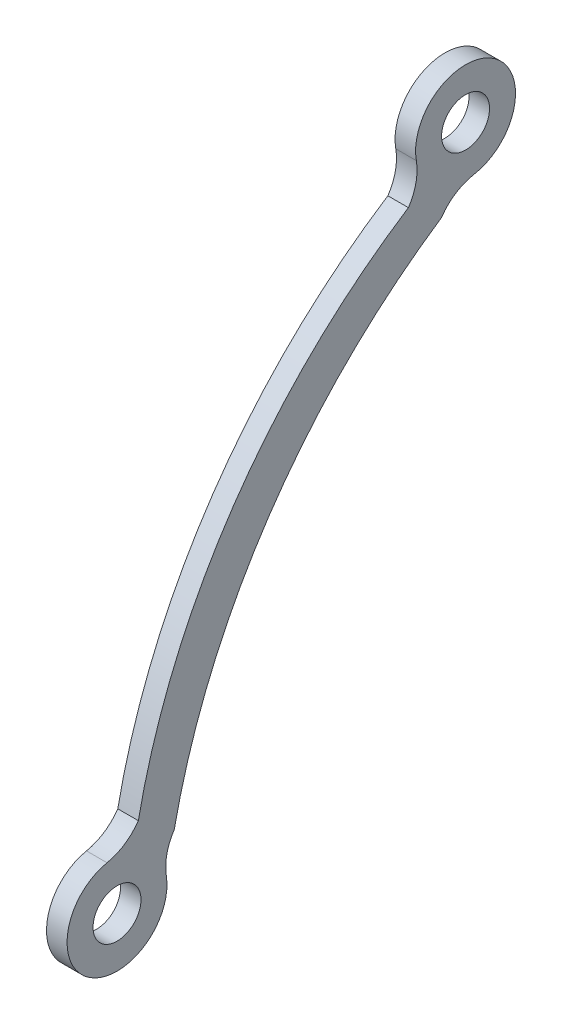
ISO-10303-21;
HEADER;
FILE_DESCRIPTION(('STEP AP214'),'2;1');
FILE_NAME('part.step','',(''),(''),'','','');
FILE_SCHEMA(('AUTOMOTIVE_DESIGN { 1 0 10303 214 1 1 1 1 }'));
ENDSEC;
DATA;
#1=APPLICATION_CONTEXT('core data for automotive mechanical design processes');
#2=APPLICATION_PROTOCOL_DEFINITION('international standard','automotive_design',2000,#1);
#3=PRODUCT_CONTEXT('',#1,'mechanical');
#4=PRODUCT('Part','Part','',(#3));
#5=PRODUCT_RELATED_PRODUCT_CATEGORY('part','',(#4));
#6=PRODUCT_DEFINITION_FORMATION('','',#4);
#7=PRODUCT_DEFINITION_CONTEXT('part definition',#1,'design');
#8=PRODUCT_DEFINITION('design','',#6,#7);
#9=PRODUCT_DEFINITION_SHAPE('','',#8);
#10=(LENGTH_UNIT() NAMED_UNIT(*) SI_UNIT(.MILLI.,.METRE.));
#11=(NAMED_UNIT(*) PLANE_ANGLE_UNIT() SI_UNIT($,.RADIAN.));
#12=(NAMED_UNIT(*) SI_UNIT($,.STERADIAN.) SOLID_ANGLE_UNIT());
#13=UNCERTAINTY_MEASURE_WITH_UNIT(LENGTH_MEASURE(1.E-05),#10,'distance_accuracy_value','');
#14=(GEOMETRIC_REPRESENTATION_CONTEXT(3) GLOBAL_UNCERTAINTY_ASSIGNED_CONTEXT((#13)) GLOBAL_UNIT_ASSIGNED_CONTEXT((#10,
#11,#12)) REPRESENTATION_CONTEXT('',''));
#15=CARTESIAN_POINT('',(0.,0.,0.));
#16=DIRECTION('',(0.,0.,1.));
#17=DIRECTION('',(1.,0.,0.));
#18=AXIS2_PLACEMENT_3D('',#15,#16,#17);
#19=CARTESIAN_POINT('',(6.05204262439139,6.22124189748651,-4.1631561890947));
#20=DIRECTION('',(1.,0.,0.));
#21=DIRECTION('',(0.,0.,-1.));
#22=AXIS2_PLACEMENT_3D('',#19,#20,#21);
#23=PLANE('',#22);
#24=CARTESIAN_POINT('',(6.05204262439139,-58.570261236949,-71.1131880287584));
#25=DIRECTION('',(1.,0.,0.));
#26=DIRECTION('',(0.,0.,-1.));
#27=AXIS2_PLACEMENT_3D('',#24,#25,#26);
#28=CIRCLE('',#27,92.4778480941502);
#29=CARTESIAN_POINT('',(6.05204262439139,18.2301021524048,-19.5975926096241));
#30=VERTEX_POINT('',#29);
#31=CARTESIAN_POINT('',(6.05204262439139,-39.6442861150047,19.4073060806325));
#32=VERTEX_POINT('',#31);
#33=EDGE_CURVE('E377',#30,#32,#28,.T.);
#34=ORIENTED_EDGE('',*,*,#33,.F.);
#35=CARTESIAN_POINT('',(6.05204262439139,14.1549426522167,-25.6442013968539));
#36=DIRECTION('',(1.,0.,0.));
#37=DIRECTION('',(0.,0.,-1.));
#38=AXIS2_PLACEMENT_3D('',#35,#36,#37);
#39=CIRCLE('',#38,7.29166666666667);
#40=CARTESIAN_POINT('',(6.05204262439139,21.3362679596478,-24.3804887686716));
#41=VERTEX_POINT('',#40);
#42=EDGE_CURVE('E99',#41,#30,#39,.T.);
#43=ORIENTED_EDGE('',*,*,#42,.F.);
#44=CARTESIAN_POINT('',(6.05204262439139,28.5175932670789,-23.1167761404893));
#45=DIRECTION('',(1.,0.,0.));
#46=DIRECTION('',(0.,0.,-1.));
#47=AXIS2_PLACEMENT_3D('',#44,#45,#46);
#48=CIRCLE('',#47,7.29166666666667);
#49=CARTESIAN_POINT('',(6.05204262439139,27.2671641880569,-15.9331259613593));
#50=VERTEX_POINT('',#49);
#51=EDGE_CURVE('E155',#41,#50,#48,.T.);
#52=ORIENTED_EDGE('',*,*,#51,.T.);
#53=CARTESIAN_POINT('',(6.05204262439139,26.016735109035,-8.74947578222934));
#54=DIRECTION('',(1.,0.,0.));
#55=DIRECTION('',(0.,0.,-1.));
#56=AXIS2_PLACEMENT_3D('',#53,#54,#55);
#57=CIRCLE('',#56,7.29166666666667);
#58=CARTESIAN_POINT('',(6.05204262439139,21.9074543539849,-14.7729477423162));
#59=VERTEX_POINT('',#58);
#60=EDGE_CURVE('E165',#59,#50,#57,.T.);
#61=ORIENTED_EDGE('',*,*,#60,.F.);
#62=CARTESIAN_POINT('',(6.05204262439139,-53.8680986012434,-63.7894635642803));
#63=DIRECTION('',(1.,0.,0.));
#64=DIRECTION('',(0.,0.,-1.));
#65=AXIS2_PLACEMENT_3D('',#62,#63,#64);
#66=CIRCLE('',#65,90.2471786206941);
#67=CARTESIAN_POINT('',(6.05204262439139,-35.8727778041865,24.6453806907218));
#68=VERTEX_POINT('',#67);
#69=EDGE_CURVE('E169',#68,#59,#66,.F.);
#70=ORIENTED_EDGE('',*,*,#69,.F.);
#71=CARTESIAN_POINT('',(6.05204262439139,-31.7634970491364,30.6688526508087));
#72=DIRECTION('',(1.,0.,0.));
#73=DIRECTION('',(0.,0.,-1.));
#74=AXIS2_PLACEMENT_3D('',#71,#72,#73);
#75=CIRCLE('',#74,7.29166666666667);
#76=CARTESIAN_POINT('',(6.05204262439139,-38.9082433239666,29.2124861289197));
#77=VERTEX_POINT('',#76);
#78=EDGE_CURVE('E171',#68,#77,#75,.F.);
#79=ORIENTED_EDGE('',*,*,#78,.T.);
#80=CARTESIAN_POINT('',(6.05204262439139,-46.0529895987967,27.7561196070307));
#81=DIRECTION('',(1.,0.,0.));
#82=DIRECTION('',(0.,0.,-1.));
#83=AXIS2_PLACEMENT_3D('',#80,#81,#82);
#84=CIRCLE('',#83,7.29166666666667);
#85=CARTESIAN_POINT('',(6.05204262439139,-44.8862176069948,20.5584084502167));
#86=VERTEX_POINT('',#85);
#87=EDGE_CURVE('E177',#86,#77,#84,.F.);
#88=ORIENTED_EDGE('',*,*,#87,.F.);
#89=CARTESIAN_POINT('',(6.05204262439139,-43.7194456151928,13.3606972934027));
#90=DIRECTION('',(1.,0.,0.));
#91=DIRECTION('',(0.,0.,-1.));
#92=AXIS2_PLACEMENT_3D('',#89,#90,#91);
#93=CIRCLE('',#92,7.29166666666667);
#94=EDGE_CURVE('E180',#86,#32,#93,.F.);
#95=ORIENTED_EDGE('',*,*,#94,.T.);
#96=EDGE_LOOP('',(#34,#43,#52,#61,#70,#79,#88,#95));
#97=FACE_BOUND('',#96,.T.);
#98=CARTESIAN_POINT('',(6.05204262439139,28.5175932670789,-23.1167761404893));
#99=DIRECTION('',(1.,0.,0.));
#100=DIRECTION('',(0.,0.,-1.));
#101=AXIS2_PLACEMENT_3D('',#98,#99,#100);
#102=CIRCLE('',#101,3.5);
#103=CARTESIAN_POINT('',(6.05204262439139,28.5175932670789,-26.6167761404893));
#104=VERTEX_POINT('',#103);
#105=EDGE_CURVE('E137',#104,#104,#102,.T.);
#106=ORIENTED_EDGE('',*,*,#105,.F.);
#107=EDGE_LOOP('',(#106));
#108=FACE_BOUND('',#107,.T.);
#109=CARTESIAN_POINT('',(6.05204262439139,-46.0529895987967,27.7561196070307));
#110=DIRECTION('',(1.,0.,0.));
#111=DIRECTION('',(0.,0.,-1.));
#112=AXIS2_PLACEMENT_3D('',#109,#110,#111);
#113=CIRCLE('',#112,3.5);
#114=CARTESIAN_POINT('',(6.05204262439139,-46.0529895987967,24.2561196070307));
#115=VERTEX_POINT('',#114);
#116=EDGE_CURVE('E103',#115,#115,#113,.F.);
#117=ORIENTED_EDGE('',*,*,#116,.T.);
#118=EDGE_LOOP('',(#117));
#119=FACE_BOUND('',#118,.T.);
#120=ADVANCED_FACE('F42',(#97,#108,#119),#23,.T.);
#121=CARTESIAN_POINT('',(3.05204262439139,6.22124189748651,-4.1631561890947));
#122=DIRECTION('',(1.,0.,0.));
#123=DIRECTION('',(0.,0.,-1.));
#124=AXIS2_PLACEMENT_3D('',#121,#122,#123);
#125=PLANE('',#124);
#126=CARTESIAN_POINT('',(3.05204262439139,-58.570261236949,-71.1131880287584));
#127=DIRECTION('',(1.,0.,0.));
#128=DIRECTION('',(0.,0.,-1.));
#129=AXIS2_PLACEMENT_3D('',#126,#127,#128);
#130=CIRCLE('',#129,92.4778480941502);
#131=CARTESIAN_POINT('',(3.05204262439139,18.2301021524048,-19.5975926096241));
#132=VERTEX_POINT('',#131);
#133=CARTESIAN_POINT('',(3.05204262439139,-39.6442861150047,19.4073060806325));
#134=VERTEX_POINT('',#133);
#135=EDGE_CURVE('E109',#132,#134,#130,.T.);
#136=ORIENTED_EDGE('',*,*,#135,.T.);
#137=CARTESIAN_POINT('',(3.05204262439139,-43.7194456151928,13.3606972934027));
#138=DIRECTION('',(1.,0.,0.));
#139=DIRECTION('',(0.,0.,-1.));
#140=AXIS2_PLACEMENT_3D('',#137,#138,#139);
#141=CIRCLE('',#140,7.29166666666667);
#142=CARTESIAN_POINT('',(3.05204262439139,-44.8862176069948,20.5584084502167));
#143=VERTEX_POINT('',#142);
#144=EDGE_CURVE('E120',#143,#134,#141,.F.);
#145=ORIENTED_EDGE('',*,*,#144,.F.);
#146=CARTESIAN_POINT('',(3.05204262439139,-46.0529895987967,27.7561196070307));
#147=DIRECTION('',(1.,0.,0.));
#148=DIRECTION('',(0.,0.,-1.));
#149=AXIS2_PLACEMENT_3D('',#146,#147,#148);
#150=CIRCLE('',#149,7.29166666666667);
#151=CARTESIAN_POINT('',(3.05204262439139,-38.9082433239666,29.2124861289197));
#152=VERTEX_POINT('',#151);
#153=EDGE_CURVE('E123',#143,#152,#150,.F.);
#154=ORIENTED_EDGE('',*,*,#153,.T.);
#155=CARTESIAN_POINT('',(3.05204262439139,-31.7634970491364,30.6688526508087));
#156=DIRECTION('',(1.,0.,0.));
#157=DIRECTION('',(0.,0.,-1.));
#158=AXIS2_PLACEMENT_3D('',#155,#156,#157);
#159=CIRCLE('',#158,7.29166666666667);
#160=CARTESIAN_POINT('',(3.05204262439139,-35.8727778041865,24.6453806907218));
#161=VERTEX_POINT('',#160);
#162=EDGE_CURVE('E126',#161,#152,#159,.F.);
#163=ORIENTED_EDGE('',*,*,#162,.F.);
#164=CARTESIAN_POINT('',(3.05204262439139,-53.8680986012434,-63.7894635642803));
#165=DIRECTION('',(1.,0.,0.));
#166=DIRECTION('',(0.,0.,-1.));
#167=AXIS2_PLACEMENT_3D('',#164,#165,#166);
#168=CIRCLE('',#167,90.2471786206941);
#169=CARTESIAN_POINT('',(3.05204262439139,21.9074543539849,-14.7729477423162));
#170=VERTEX_POINT('',#169);
#171=EDGE_CURVE('E129',#161,#170,#168,.F.);
#172=ORIENTED_EDGE('',*,*,#171,.T.);
#173=CARTESIAN_POINT('',(3.05204262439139,26.016735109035,-8.74947578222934));
#174=DIRECTION('',(1.,0.,0.));
#175=DIRECTION('',(0.,0.,-1.));
#176=AXIS2_PLACEMENT_3D('',#173,#174,#175);
#177=CIRCLE('',#176,7.29166666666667);
#178=CARTESIAN_POINT('',(3.05204262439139,27.2671641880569,-15.9331259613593));
#179=VERTEX_POINT('',#178);
#180=EDGE_CURVE('E132',#170,#179,#177,.T.);
#181=ORIENTED_EDGE('',*,*,#180,.T.);
#182=CARTESIAN_POINT('',(3.05204262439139,28.5175932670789,-23.1167761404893));
#183=DIRECTION('',(1.,0.,0.));
#184=DIRECTION('',(0.,0.,-1.));
#185=AXIS2_PLACEMENT_3D('',#182,#183,#184);
#186=CIRCLE('',#185,7.29166666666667);
#187=CARTESIAN_POINT('',(3.05204262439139,21.3362679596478,-24.3804887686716));
#188=VERTEX_POINT('',#187);
#189=EDGE_CURVE('E111',#188,#179,#186,.T.);
#190=ORIENTED_EDGE('',*,*,#189,.F.);
#191=CARTESIAN_POINT('',(3.05204262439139,14.1549426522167,-25.6442013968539));
#192=DIRECTION('',(1.,0.,0.));
#193=DIRECTION('',(0.,0.,-1.));
#194=AXIS2_PLACEMENT_3D('',#191,#192,#193);
#195=CIRCLE('',#194,7.29166666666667);
#196=EDGE_CURVE('E97',#188,#132,#195,.T.);
#197=ORIENTED_EDGE('',*,*,#196,.T.);
#198=EDGE_LOOP('',(#136,#145,#154,#163,#172,#181,#190,#197));
#199=FACE_BOUND('',#198,.T.);
#200=CARTESIAN_POINT('',(3.05204262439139,28.5175932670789,-23.1167761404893));
#201=DIRECTION('',(1.,0.,0.));
#202=DIRECTION('',(0.,0.,-1.));
#203=AXIS2_PLACEMENT_3D('',#200,#201,#202);
#204=CIRCLE('',#203,3.5);
#205=CARTESIAN_POINT('',(3.05204262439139,28.5175932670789,-26.6167761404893));
#206=VERTEX_POINT('',#205);
#207=EDGE_CURVE('E114',#206,#206,#204,.T.);
#208=ORIENTED_EDGE('',*,*,#207,.T.);
#209=EDGE_LOOP('',(#208));
#210=FACE_BOUND('',#209,.T.);
#211=CARTESIAN_POINT('',(3.05204262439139,-46.0529895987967,27.7561196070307));
#212=DIRECTION('',(1.,0.,0.));
#213=DIRECTION('',(0.,0.,-1.));
#214=AXIS2_PLACEMENT_3D('',#211,#212,#213);
#215=CIRCLE('',#214,3.5);
#216=CARTESIAN_POINT('',(3.05204262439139,-46.0529895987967,24.2561196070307));
#217=VERTEX_POINT('',#216);
#218=EDGE_CURVE('E122',#217,#217,#215,.F.);
#219=ORIENTED_EDGE('',*,*,#218,.F.);
#220=EDGE_LOOP('',(#219));
#221=FACE_BOUND('',#220,.T.);
#222=ADVANCED_FACE('F106',(#199,#210,#221),#125,.F.);
#223=CARTESIAN_POINT('',(6.05204262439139,28.5175932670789,-23.1167761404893));
#224=DIRECTION('',(1.,0.,0.));
#225=DIRECTION('',(0.,0.,-1.));
#226=AXIS2_PLACEMENT_3D('',#223,#224,#225);
#227=CYLINDRICAL_SURFACE('',#226,7.29166666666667);
#228=DIRECTION('',(1.,0.,0.));
#229=VECTOR('',#228,1.);
#230=CARTESIAN_POINT('',(6.05204262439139,21.3362679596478,-24.3804887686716));
#231=LINE('',#230,#229);
#232=EDGE_CURVE('E11',#188,#41,#231,.T.);
#233=ORIENTED_EDGE('',*,*,#232,.F.);
#234=ORIENTED_EDGE('',*,*,#189,.T.);
#235=DIRECTION('',(1.,0.,0.));
#236=VECTOR('',#235,1.);
#237=CARTESIAN_POINT('',(6.05204262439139,27.2671641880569,-15.9331259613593));
#238=LINE('',#237,#236);
#239=EDGE_CURVE('E52',#179,#50,#238,.T.);
#240=ORIENTED_EDGE('',*,*,#239,.T.);
#241=ORIENTED_EDGE('',*,*,#51,.F.);
#242=EDGE_LOOP('',(#233,#234,#240,#241));
#243=FACE_BOUND('',#242,.T.);
#244=ADVANCED_FACE('F153',(#243),#227,.T.);
#245=CARTESIAN_POINT('',(6.05204262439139,26.016735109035,-8.74947578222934));
#246=DIRECTION('',(1.,0.,0.));
#247=DIRECTION('',(0.,0.,-1.));
#248=AXIS2_PLACEMENT_3D('',#245,#246,#247);
#249=CYLINDRICAL_SURFACE('',#248,7.29166666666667);
#250=ORIENTED_EDGE('',*,*,#239,.F.);
#251=ORIENTED_EDGE('',*,*,#180,.F.);
#252=DIRECTION('',(1.,0.,0.));
#253=VECTOR('',#252,1.);
#254=CARTESIAN_POINT('',(6.05204262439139,21.9074543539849,-14.7729477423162));
#255=LINE('',#254,#253);
#256=EDGE_CURVE('E147',#170,#59,#255,.T.);
#257=ORIENTED_EDGE('',*,*,#256,.T.);
#258=ORIENTED_EDGE('',*,*,#60,.T.);
#259=EDGE_LOOP('',(#250,#251,#257,#258));
#260=FACE_BOUND('',#259,.T.);
#261=ADVANCED_FACE('F168',(#260),#249,.F.);
#262=CARTESIAN_POINT('',(6.05204262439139,-53.8680986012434,-63.7894635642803));
#263=DIRECTION('',(1.,0.,0.));
#264=DIRECTION('',(0.,0.,-1.));
#265=AXIS2_PLACEMENT_3D('',#262,#263,#264);
#266=CYLINDRICAL_SURFACE('',#265,90.2471786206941);
#267=ORIENTED_EDGE('',*,*,#256,.F.);
#268=ORIENTED_EDGE('',*,*,#171,.F.);
#269=DIRECTION('',(1.,0.,0.));
#270=VECTOR('',#269,1.);
#271=CARTESIAN_POINT('',(6.05204262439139,-35.8727778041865,24.6453806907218));
#272=LINE('',#271,#270);
#273=EDGE_CURVE('E144',#161,#68,#272,.T.);
#274=ORIENTED_EDGE('',*,*,#273,.T.);
#275=ORIENTED_EDGE('',*,*,#69,.T.);
#276=EDGE_LOOP('',(#267,#268,#274,#275));
#277=FACE_BOUND('',#276,.T.);
#278=ADVANCED_FACE('F215',(#277),#266,.T.);
#279=CARTESIAN_POINT('',(6.05204262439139,-31.7634970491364,30.6688526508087));
#280=DIRECTION('',(1.,0.,0.));
#281=DIRECTION('',(0.,0.,-1.));
#282=AXIS2_PLACEMENT_3D('',#279,#280,#281);
#283=CYLINDRICAL_SURFACE('',#282,7.29166666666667);
#284=ORIENTED_EDGE('',*,*,#273,.F.);
#285=ORIENTED_EDGE('',*,*,#162,.T.);
#286=DIRECTION('',(1.,0.,0.));
#287=VECTOR('',#286,1.);
#288=CARTESIAN_POINT('',(6.05204262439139,-38.9082433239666,29.2124861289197));
#289=LINE('',#288,#287);
#290=EDGE_CURVE('E141',#152,#77,#289,.T.);
#291=ORIENTED_EDGE('',*,*,#290,.T.);
#292=ORIENTED_EDGE('',*,*,#78,.F.);
#293=EDGE_LOOP('',(#284,#285,#291,#292));
#294=FACE_BOUND('',#293,.T.);
#295=ADVANCED_FACE('F211',(#294),#283,.F.);
#296=CARTESIAN_POINT('',(6.05204262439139,-46.0529895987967,27.7561196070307));
#297=DIRECTION('',(1.,0.,0.));
#298=DIRECTION('',(0.,0.,-1.));
#299=AXIS2_PLACEMENT_3D('',#296,#297,#298);
#300=CYLINDRICAL_SURFACE('',#299,7.29166666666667);
#301=ORIENTED_EDGE('',*,*,#290,.F.);
#302=ORIENTED_EDGE('',*,*,#153,.F.);
#303=DIRECTION('',(1.,0.,0.));
#304=VECTOR('',#303,1.);
#305=CARTESIAN_POINT('',(6.05204262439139,-44.8862176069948,20.5584084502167));
#306=LINE('',#305,#304);
#307=EDGE_CURVE('E139',#143,#86,#306,.T.);
#308=ORIENTED_EDGE('',*,*,#307,.T.);
#309=ORIENTED_EDGE('',*,*,#87,.T.);
#310=EDGE_LOOP('',(#301,#302,#308,#309));
#311=FACE_BOUND('',#310,.T.);
#312=ADVANCED_FACE('F208',(#311),#300,.T.);
#313=CARTESIAN_POINT('',(6.05204262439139,-43.7194456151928,13.3606972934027));
#314=DIRECTION('',(1.,0.,0.));
#315=DIRECTION('',(0.,0.,-1.));
#316=AXIS2_PLACEMENT_3D('',#313,#314,#315);
#317=CYLINDRICAL_SURFACE('',#316,7.29166666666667);
#318=ORIENTED_EDGE('',*,*,#307,.F.);
#319=ORIENTED_EDGE('',*,*,#144,.T.);
#320=DIRECTION('',(1.,0.,0.));
#321=VECTOR('',#320,1.);
#322=CARTESIAN_POINT('',(6.05204262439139,-39.6442861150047,19.4073060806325));
#323=LINE('',#322,#321);
#324=EDGE_CURVE('E60',#134,#32,#323,.T.);
#325=ORIENTED_EDGE('',*,*,#324,.T.);
#326=ORIENTED_EDGE('',*,*,#94,.F.);
#327=EDGE_LOOP('',(#318,#319,#325,#326));
#328=FACE_BOUND('',#327,.T.);
#329=ADVANCED_FACE('F205',(#328),#317,.F.);
#330=CARTESIAN_POINT('',(6.05204262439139,-58.570261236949,-71.1131880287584));
#331=DIRECTION('',(1.,0.,0.));
#332=DIRECTION('',(0.,0.,-1.));
#333=AXIS2_PLACEMENT_3D('',#330,#331,#332);
#334=CYLINDRICAL_SURFACE('',#333,92.4778480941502);
#335=ORIENTED_EDGE('',*,*,#324,.F.);
#336=ORIENTED_EDGE('',*,*,#135,.F.);
#337=DIRECTION('',(1.,0.,0.));
#338=VECTOR('',#337,1.);
#339=CARTESIAN_POINT('',(6.05204262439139,18.2301021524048,-19.5975926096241));
#340=LINE('',#339,#338);
#341=EDGE_CURVE('E46',#132,#30,#340,.T.);
#342=ORIENTED_EDGE('',*,*,#341,.T.);
#343=ORIENTED_EDGE('',*,*,#33,.T.);
#344=EDGE_LOOP('',(#335,#336,#342,#343));
#345=FACE_BOUND('',#344,.T.);
#346=ADVANCED_FACE('F113',(#345),#334,.F.);
#347=CARTESIAN_POINT('',(6.05204262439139,28.5175932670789,-23.1167761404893));
#348=DIRECTION('',(1.,0.,0.));
#349=DIRECTION('',(0.,0.,-1.));
#350=AXIS2_PLACEMENT_3D('',#347,#348,#349);
#351=CYLINDRICAL_SURFACE('',#350,3.5);
#352=ORIENTED_EDGE('',*,*,#105,.T.);
#353=EDGE_LOOP('',(#352));
#354=FACE_BOUND('',#353,.T.);
#355=ORIENTED_EDGE('',*,*,#207,.F.);
#356=EDGE_LOOP('',(#355));
#357=FACE_BOUND('',#356,.T.);
#358=ADVANCED_FACE('F199',(#354,#357),#351,.F.);
#359=CARTESIAN_POINT('',(6.05204262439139,14.1549426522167,-25.6442013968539));
#360=DIRECTION('',(1.,0.,0.));
#361=DIRECTION('',(0.,0.,-1.));
#362=AXIS2_PLACEMENT_3D('',#359,#360,#361);
#363=CYLINDRICAL_SURFACE('',#362,7.29166666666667);
#364=ORIENTED_EDGE('',*,*,#196,.F.);
#365=ORIENTED_EDGE('',*,*,#232,.T.);
#366=ORIENTED_EDGE('',*,*,#42,.T.);
#367=ORIENTED_EDGE('',*,*,#341,.F.);
#368=EDGE_LOOP('',(#364,#365,#366,#367));
#369=FACE_BOUND('',#368,.T.);
#370=ADVANCED_FACE('F96',(#369),#363,.F.);
#371=CARTESIAN_POINT('',(6.05204262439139,-46.0529895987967,27.7561196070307));
#372=DIRECTION('',(1.,0.,0.));
#373=DIRECTION('',(0.,0.,-1.));
#374=AXIS2_PLACEMENT_3D('',#371,#372,#373);
#375=CYLINDRICAL_SURFACE('',#374,3.5);
#376=ORIENTED_EDGE('',*,*,#116,.F.);
#377=EDGE_LOOP('',(#376));
#378=FACE_BOUND('',#377,.T.);
#379=ORIENTED_EDGE('',*,*,#218,.T.);
#380=EDGE_LOOP('',(#379));
#381=FACE_BOUND('',#380,.T.);
#382=ADVANCED_FACE('F44',(#378,#381),#375,.F.);
#383=CLOSED_SHELL('',(#120,#222,#244,#261,#278,#295,#312,#329,#346,#358,#370,#382));
#384=MANIFOLD_SOLID_BREP('B2',#383);
#385=ADVANCED_BREP_SHAPE_REPRESENTATION('',(#18,#384),#14);
#386=SHAPE_DEFINITION_REPRESENTATION(#9,#385);
ENDSEC;
END-ISO-10303-21;
